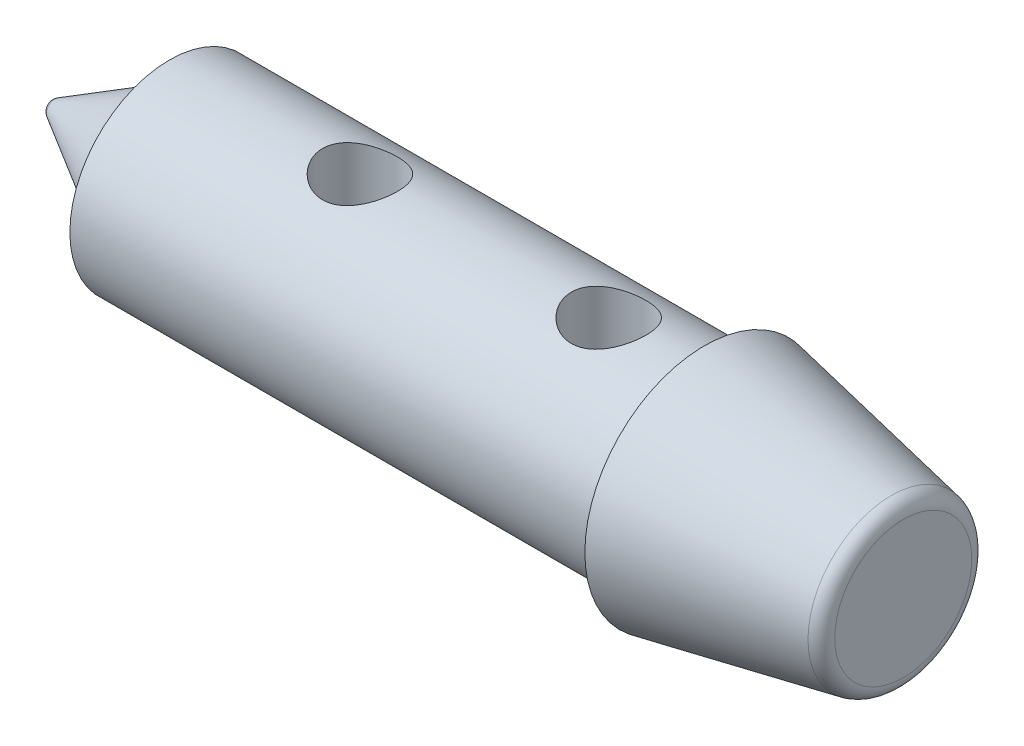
ISO-10303-21;
HEADER;
FILE_DESCRIPTION(('STEP AP214'),'2;1');
FILE_NAME('part.step','',(''),(''),'','','');
FILE_SCHEMA(('AUTOMOTIVE_DESIGN { 1 0 10303 214 1 1 1 1 }'));
ENDSEC;
DATA;
#1=APPLICATION_CONTEXT('core data for automotive mechanical design processes');
#2=APPLICATION_PROTOCOL_DEFINITION('international standard','automotive_design',2000,#1);
#3=PRODUCT_CONTEXT('',#1,'mechanical');
#4=PRODUCT('Part','Part','',(#3));
#5=PRODUCT_RELATED_PRODUCT_CATEGORY('part','',(#4));
#6=PRODUCT_DEFINITION_FORMATION('','',#4);
#7=PRODUCT_DEFINITION_CONTEXT('part definition',#1,'design');
#8=PRODUCT_DEFINITION('design','',#6,#7);
#9=PRODUCT_DEFINITION_SHAPE('','',#8);
#10=(LENGTH_UNIT() NAMED_UNIT(*) SI_UNIT(.MILLI.,.METRE.));
#11=(NAMED_UNIT(*) PLANE_ANGLE_UNIT() SI_UNIT($,.RADIAN.));
#12=(NAMED_UNIT(*) SI_UNIT($,.STERADIAN.) SOLID_ANGLE_UNIT());
#13=UNCERTAINTY_MEASURE_WITH_UNIT(LENGTH_MEASURE(1.E-05),#10,'distance_accuracy_value','');
#14=(GEOMETRIC_REPRESENTATION_CONTEXT(3) GLOBAL_UNCERTAINTY_ASSIGNED_CONTEXT((#13)) GLOBAL_UNIT_ASSIGNED_CONTEXT((#10,
#11,#12)) REPRESENTATION_CONTEXT('',''));
#15=CARTESIAN_POINT('',(0.,0.,0.));
#16=DIRECTION('',(0.,0.,1.));
#17=DIRECTION('',(1.,0.,0.));
#18=AXIS2_PLACEMENT_3D('',#15,#16,#17);
#19=CARTESIAN_POINT('',(0.852323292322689,0.,0.));
#20=DIRECTION('',(1.,0.,0.));
#21=DIRECTION('',(0.,0.,-1.));
#22=AXIS2_PLACEMENT_3D('',#19,#20,#21);
#23=CONICAL_SURFACE('',#22,3.75,0.523598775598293);
#24=CARTESIAN_POINT('',(-4.89286723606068,0.,0.));
#25=DIRECTION('',(-1.,0.,0.));
#26=DIRECTION('',(0.,0.,1.));
#27=AXIS2_PLACEMENT_3D('',#24,#25,#26);
#28=CIRCLE('',#27,0.433012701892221);
#29=CARTESIAN_POINT('',(-4.89286723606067,0.,-0.433012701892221));
#30=VERTEX_POINT('',#29);
#31=EDGE_CURVE('E109',#30,#30,#28,.T.);
#32=CARTESIAN_POINT('',(0.852323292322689,0.,0.));
#33=DIRECTION('',(-1.,0.,0.));
#34=DIRECTION('',(0.,0.,1.));
#35=AXIS2_PLACEMENT_3D('',#32,#33,#34);
#36=CIRCLE('',#35,3.75);
#37=CARTESIAN_POINT('',(0.852323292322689,0.,-3.75));
#38=VERTEX_POINT('',#37);
#39=EDGE_CURVE('E96',#38,#38,#36,.T.);
#40=CARTESIAN_POINT('',(-4.89286723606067,0.,-0.433012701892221));
#41=CARTESIAN_POINT('',(-4.83302150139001,0.,-0.467564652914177));
#42=CARTESIAN_POINT('',(-4.77317576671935,0.,-0.502116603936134));
#43=CARTESIAN_POINT('',(-4.65348429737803,0.,-0.571220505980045));
#44=CARTESIAN_POINT('',(-4.59363856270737,0.,-0.605772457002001));
#45=CARTESIAN_POINT('',(-4.47394709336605,0.,-0.674876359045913));
#46=CARTESIAN_POINT('',(-4.41410135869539,0.,-0.709428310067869));
#47=CARTESIAN_POINT('',(-4.29440988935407,0.,-0.778532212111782));
#48=CARTESIAN_POINT('',(-4.23456415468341,0.,-0.813084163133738));
#49=CARTESIAN_POINT('',(-4.11487268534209,0.,-0.88218806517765));
#50=CARTESIAN_POINT('',(-4.05502695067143,0.,-0.916740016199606));
#51=CARTESIAN_POINT('',(-3.93533548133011,0.,-0.985843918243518));
#52=CARTESIAN_POINT('',(-3.87548974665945,0.,-1.02039586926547));
#53=CARTESIAN_POINT('',(-3.75579827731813,0.,-1.08949977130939));
#54=CARTESIAN_POINT('',(-3.69595254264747,0.,-1.12405172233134));
#55=CARTESIAN_POINT('',(-3.57626107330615,0.,-1.19315562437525));
#56=CARTESIAN_POINT('',(-3.51641533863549,0.,-1.22770757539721));
#57=CARTESIAN_POINT('',(-3.39672386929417,0.,-1.29681147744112));
#58=CARTESIAN_POINT('',(-3.33687813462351,0.,-1.33136342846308));
#59=CARTESIAN_POINT('',(-3.21718666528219,0.,-1.40046733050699));
#60=CARTESIAN_POINT('',(-3.15734093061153,0.,-1.43501928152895));
#61=CARTESIAN_POINT('',(-3.03764946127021,0.,-1.50412318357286));
#62=CARTESIAN_POINT('',(-2.97780372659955,0.,-1.53867513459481));
#63=CARTESIAN_POINT('',(-2.85811225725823,0.,-1.60777903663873));
#64=CARTESIAN_POINT('',(-2.79826652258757,0.,-1.64233098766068));
#65=CARTESIAN_POINT('',(-2.67857505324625,0.,-1.71143488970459));
#66=CARTESIAN_POINT('',(-2.61872931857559,0.,-1.74598684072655));
#67=CARTESIAN_POINT('',(-2.49903784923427,0.,-1.81509074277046));
#68=CARTESIAN_POINT('',(-2.43919211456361,0.,-1.84964269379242));
#69=CARTESIAN_POINT('',(-2.31950064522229,0.,-1.91874659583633));
#70=CARTESIAN_POINT('',(-2.25965491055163,0.,-1.95329854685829));
#71=CARTESIAN_POINT('',(-2.13996344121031,0.,-2.0224024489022));
#72=CARTESIAN_POINT('',(-2.08011770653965,0.,-2.05695439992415));
#73=CARTESIAN_POINT('',(-1.96042623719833,0.,-2.12605830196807));
#74=CARTESIAN_POINT('',(-1.90058050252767,0.,-2.16061025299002));
#75=CARTESIAN_POINT('',(-1.78088903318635,0.,-2.22971415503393));
#76=CARTESIAN_POINT('',(-1.72104329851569,0.,-2.26426610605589));
#77=CARTESIAN_POINT('',(-1.60135182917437,0.,-2.3333700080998));
#78=CARTESIAN_POINT('',(-1.54150609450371,0.,-2.36792195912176));
#79=CARTESIAN_POINT('',(-1.42181462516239,0.,-2.43702586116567));
#80=CARTESIAN_POINT('',(-1.36196889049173,0.,-2.47157781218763));
#81=CARTESIAN_POINT('',(-1.24227742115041,0.,-2.54068171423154));
#82=CARTESIAN_POINT('',(-1.18243168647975,0.,-2.57523366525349));
#83=CARTESIAN_POINT('',(-1.06274021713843,0.,-2.64433756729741));
#84=CARTESIAN_POINT('',(-1.00289448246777,0.,-2.67888951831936));
#85=CARTESIAN_POINT('',(-0.883203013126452,0.,-2.74799342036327));
#86=CARTESIAN_POINT('',(-0.823357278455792,0.,-2.78254537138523));
#87=CARTESIAN_POINT('',(-0.703665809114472,0.,-2.85164927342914));
#88=CARTESIAN_POINT('',(-0.643820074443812,0.,-2.8862012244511));
#89=CARTESIAN_POINT('',(-0.524128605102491,0.,-2.95530512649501));
#90=CARTESIAN_POINT('',(-0.464282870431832,0.,-2.98985707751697));
#91=CARTESIAN_POINT('',(-0.344591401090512,0.,-3.05896097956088));
#92=CARTESIAN_POINT('',(-0.284745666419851,0.,-3.09351293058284));
#93=CARTESIAN_POINT('',(-0.165054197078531,0.,-3.16261683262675));
#94=CARTESIAN_POINT('',(-0.105208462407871,0.,-3.1971687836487));
#95=CARTESIAN_POINT('',(0.0144830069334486,0.,-3.26627268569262));
#96=CARTESIAN_POINT('',(0.0743287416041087,0.,-3.30082463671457));
#97=CARTESIAN_POINT('',(0.194020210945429,0.,-3.36992853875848));
#98=CARTESIAN_POINT('',(0.253865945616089,0.,-3.40448048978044));
#99=CARTESIAN_POINT('',(0.373557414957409,0.,-3.47358439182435));
#100=CARTESIAN_POINT('',(0.433403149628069,0.,-3.50813634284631));
#101=CARTESIAN_POINT('',(0.553094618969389,0.,-3.57724024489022));
#102=CARTESIAN_POINT('',(0.612940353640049,0.,-3.61179219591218));
#103=CARTESIAN_POINT('',(0.732631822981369,0.,-3.68089609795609));
#104=CARTESIAN_POINT('',(0.792477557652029,0.,-3.71544804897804));
#105=CARTESIAN_POINT('',(0.852323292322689,0.,-3.75));
#106=B_SPLINE_CURVE_WITH_KNOTS('',3,(#40,#41,#42,#43,#44,#45,#46,#47,#48,#49,#50,#51,#52,#53,
#54,#55,#56,#57,#58,#59,#60,#61,#62,#63,#64,#65,#66,#67,#68,#69,#70,#71,#72,#73,#74,#75,#76,#77,
#78,#79,#80,#81,#82,#83,#84,#85,#86,#87,#88,#89,#90,#91,#92,#93,#94,#95,#96,#97,#98,#99,#100,
#101,#102,#103,#104,#105),.UNSPECIFIED.,.F.,.F.,(4,2,2,2,2,2,2,2,2,2,2,2,2,2,2,2,2,2,2,2,2,2,2,
2,2,2,2,2,2,2,2,2,4),(0.,0.207311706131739,0.414623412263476,0.621935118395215,
0.829246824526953,1.03655853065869,1.24387023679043,1.45118194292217,1.65849364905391,
1.86580535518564,2.07311706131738,2.28042876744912,2.48774047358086,2.6950521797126,
2.90236388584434,3.10967559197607,3.31698729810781,3.52429900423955,3.73161071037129,
3.93892241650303,4.14623412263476,4.3535458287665,4.56085753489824,4.76816924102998,
4.97548094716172,5.18279265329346,5.3901043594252,5.59741606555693,5.80472777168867,
6.01203947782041,6.21935118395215,6.42666289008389,6.63397459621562),.UNSPECIFIED.);
#107=EDGE_CURVE('BSEAM39',#30,#38,#106,.T.);
#108=ORIENTED_EDGE('',*,*,#31,.F.);
#109=ORIENTED_EDGE('',*,*,#39,.T.);
#110=ORIENTED_EDGE('',*,*,#107,.T.);
#111=ORIENTED_EDGE('',*,*,#107,.F.);
#112=EDGE_LOOP('',(#108,#110,#109,#111));
#113=FACE_BOUND('',#112,.T.);
#114=ADVANCED_FACE('F39',(#113),#23,.T.);
#115=CARTESIAN_POINT('',(-4.64286723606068,0.,0.));
#116=DIRECTION('',(-1.,0.,0.));
#117=DIRECTION('',(0.,1.,0.));
#118=AXIS2_PLACEMENT_3D('',#115,#116,#117);
#119=SPHERICAL_SURFACE('',#118,0.5);
#120=ORIENTED_EDGE('',*,*,#31,.T.);
#121=EDGE_LOOP('',(#120));
#122=FACE_BOUND('',#121,.T.);
#123=ADVANCED_FACE('F131',(#122),#119,.T.);
#124=CARTESIAN_POINT('',(37.7273232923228,4.0625,0.));
#125=DIRECTION('',(-1.,0.,0.));
#126=DIRECTION('',(0.,0.,1.));
#127=AXIS2_PLACEMENT_3D('',#124,#125,#126);
#128=PLANE('',#127);
#129=CARTESIAN_POINT('',(37.7273232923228,0.,0.));
#130=DIRECTION('',(-1.,0.,0.));
#131=DIRECTION('',(0.,0.,1.));
#132=AXIS2_PLACEMENT_3D('',#129,#130,#131);
#133=CIRCLE('',#132,3.44386503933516);
#134=CARTESIAN_POINT('',(37.7273232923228,0.,3.44386503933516));
#135=VERTEX_POINT('',#134);
#136=EDGE_CURVE('E50',#135,#135,#133,.F.);
#137=ORIENTED_EDGE('',*,*,#136,.T.);
#138=EDGE_LOOP('',(#137));
#139=FACE_BOUND('',#138,.T.);
#140=ADVANCED_FACE('F137',(#139),#128,.F.);
#141=CARTESIAN_POINT('',(37.7273232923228,0.,0.));
#142=DIRECTION('',(-1.,0.,0.));
#143=DIRECTION('',(0.,0.,1.));
#144=AXIS2_PLACEMENT_3D('',#141,#142,#143);
#145=CONICAL_SURFACE('',#144,4.0625,0.191378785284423);
#146=CARTESIAN_POINT('',(37.1199828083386,0.,0.));
#147=DIRECTION('',(1.,0.,0.));
#148=DIRECTION('',(0.,0.,-1.));
#149=AXIS2_PLACEMENT_3D('',#146,#147,#148);
#150=CIRCLE('',#149,4.18017221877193);
#151=CARTESIAN_POINT('',(37.1199828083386,0.,-4.18017221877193));
#152=VERTEX_POINT('',#151);
#153=EDGE_CURVE('E54',#152,#152,#150,.F.);
#154=ORIENTED_EDGE('',*,*,#153,.T.);
#155=EDGE_LOOP('',(#154));
#156=FACE_BOUND('',#155,.T.);
#157=CARTESIAN_POINT('',(27.7273232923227,0.,0.));
#158=DIRECTION('',(-1.,0.,0.));
#159=DIRECTION('',(0.,0.,1.));
#160=AXIS2_PLACEMENT_3D('',#157,#158,#159);
#161=CIRCLE('',#160,6.);
#162=CARTESIAN_POINT('',(27.7273232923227,0.,6.));
#163=VERTEX_POINT('',#162);
#164=EDGE_CURVE('E105',#163,#163,#161,.T.);
#165=ORIENTED_EDGE('',*,*,#164,.F.);
#166=EDGE_LOOP('',(#165));
#167=FACE_BOUND('',#166,.T.);
#168=ADVANCED_FACE('F129',(#156,#167),#145,.T.);
#169=CARTESIAN_POINT('',(27.7273232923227,5.,0.));
#170=DIRECTION('',(1.,0.,0.));
#171=DIRECTION('',(0.,0.,-1.));
#172=AXIS2_PLACEMENT_3D('',#169,#170,#171);
#173=PLANE('',#172);
#174=CARTESIAN_POINT('',(27.7273232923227,0.,0.));
#175=DIRECTION('',(1.,0.,0.));
#176=DIRECTION('',(0.,0.,-1.));
#177=AXIS2_PLACEMENT_3D('',#174,#175,#176);
#178=CIRCLE('',#177,5.2);
#179=CARTESIAN_POINT('',(27.7273232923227,0.,-5.2));
#180=VERTEX_POINT('',#179);
#181=EDGE_CURVE('E10',#180,#180,#178,.T.);
#182=ORIENTED_EDGE('',*,*,#181,.T.);
#183=EDGE_LOOP('',(#182));
#184=FACE_BOUND('',#183,.T.);
#185=ORIENTED_EDGE('',*,*,#164,.T.);
#186=EDGE_LOOP('',(#185));
#187=FACE_BOUND('',#186,.T.);
#188=ADVANCED_FACE('F123',(#184,#187),#173,.F.);
#189=CARTESIAN_POINT('',(-4.64286723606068,0.,0.));
#190=DIRECTION('',(-1.,0.,0.));
#191=DIRECTION('',(0.,0.,1.));
#192=AXIS2_PLACEMENT_3D('',#189,#190,#191);
#193=CYLINDRICAL_SURFACE('',#192,5.);
#194=CARTESIAN_POINT('',(27.5273232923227,0.,0.));
#195=DIRECTION('',(1.,0.,0.));
#196=DIRECTION('',(0.,0.,-1.));
#197=AXIS2_PLACEMENT_3D('',#194,#195,#196);
#198=CIRCLE('',#197,5.);
#199=CARTESIAN_POINT('',(27.5273232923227,0.,-5.));
#200=VERTEX_POINT('',#199);
#201=EDGE_CURVE('E46',#200,#200,#198,.F.);
#202=ORIENTED_EDGE('',*,*,#201,.T.);
#203=EDGE_LOOP('',(#202));
#204=FACE_BOUND('',#203,.T.);
#205=CARTESIAN_POINT('',(10.4273232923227,4.63512405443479,-1.87499999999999));
#206=CARTESIAN_POINT('',(10.5285826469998,4.63512050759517,-1.87500380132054));
#207=CARTESIAN_POINT('',(10.6298169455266,4.63847825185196,-1.86676996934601));
#208=CARTESIAN_POINT('',(10.8292333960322,4.65145199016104,-1.83420234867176));
#209=CARTESIAN_POINT('',(10.92741563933,4.66106779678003,-1.80986904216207));
#210=CARTESIAN_POINT('',(11.1177925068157,4.68531850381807,-1.74612072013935));
#211=CARTESIAN_POINT('',(11.2100008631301,4.6999413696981,-1.70674184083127));
#212=CARTESIAN_POINT('',(11.3865381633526,4.73253917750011,-1.61414820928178));
#213=CARTESIAN_POINT('',(11.4708647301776,4.75051512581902,-1.56092930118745));
#214=CARTESIAN_POINT('',(11.6334361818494,4.78879468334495,-1.43933326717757));
#215=CARTESIAN_POINT('',(11.7112339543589,4.80916677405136,-1.37037976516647));
#216=CARTESIAN_POINT('',(11.8544768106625,4.84937188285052,-1.2204947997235));
#217=CARTESIAN_POINT('',(11.9199192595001,4.86920478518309,-1.1395607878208));
#218=CARTESIAN_POINT('',(12.0387476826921,4.90691092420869,-0.964618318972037));
#219=CARTESIAN_POINT('',(12.0916476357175,4.92469451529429,-0.870258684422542));
#220=CARTESIAN_POINT('',(12.1806372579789,4.95547509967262,-0.673194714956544));
#221=CARTESIAN_POINT('',(12.2167327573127,4.96847375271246,-0.570493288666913));
#222=CARTESIAN_POINT('',(12.2695206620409,4.98773371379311,-0.364361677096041));
#223=CARTESIAN_POINT('',(12.2869828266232,4.99426144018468,-0.261153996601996));
#224=CARTESIAN_POINT('',(12.3044747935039,5.00080017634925,-0.053080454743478));
#225=CARTESIAN_POINT('',(12.3045102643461,5.00081330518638,0.0517848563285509));
#226=CARTESIAN_POINT('',(12.2875960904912,4.99449082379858,0.254679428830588));
#227=CARTESIAN_POINT('',(12.2714866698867,4.98846927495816,0.352790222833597));
#228=CARTESIAN_POINT('',(12.2241533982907,4.97116593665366,0.544799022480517));
#229=CARTESIAN_POINT('',(12.192928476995,4.95988377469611,0.638696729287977));
#230=CARTESIAN_POINT('',(12.115860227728,4.93297211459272,0.821236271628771));
#231=CARTESIAN_POINT('',(12.0698107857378,4.91728174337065,0.909781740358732));
#232=CARTESIAN_POINT('',(11.9645831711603,4.88314137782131,1.07810825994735));
#233=CARTESIAN_POINT('',(11.9054007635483,4.86469049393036,1.1578864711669));
#234=CARTESIAN_POINT('',(11.7715391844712,4.82565662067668,1.31136310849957));
#235=CARTESIAN_POINT('',(11.6961558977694,4.80501204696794,1.38443268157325));
#236=CARTESIAN_POINT('',(11.534082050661,4.76478075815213,1.51712994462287));
#237=CARTESIAN_POINT('',(11.447388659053,4.74519430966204,1.57675425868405));
#238=CARTESIAN_POINT('',(11.2626739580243,4.70890879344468,1.68207014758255));
#239=CARTESIAN_POINT('',(11.1644439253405,4.69228346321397,1.72742309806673));
#240=CARTESIAN_POINT('',(10.9609530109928,4.66465548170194,1.80070580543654));
#241=CARTESIAN_POINT('',(10.8556960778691,4.65364970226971,1.82864525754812));
#242=CARTESIAN_POINT('',(10.6473533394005,4.63924496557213,1.86487739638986));
#243=CARTESIAN_POINT('',(10.5444681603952,4.63545981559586,1.87416901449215));
#244=CARTESIAN_POINT('',(10.3385615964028,4.63483174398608,1.87572357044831));
#245=CARTESIAN_POINT('',(10.235540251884,4.63798708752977,1.86799076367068));
#246=CARTESIAN_POINT('',(10.0374108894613,4.65049227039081,1.83662166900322));
#247=CARTESIAN_POINT('',(9.94215937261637,4.65954095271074,1.81375772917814));
#248=CARTESIAN_POINT('',(9.75688836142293,4.68245608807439,1.75374718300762));
#249=CARTESIAN_POINT('',(9.66686994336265,4.69632352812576,1.71659765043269));
#250=CARTESIAN_POINT('',(9.49086774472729,4.72795303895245,1.62750365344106));
#251=CARTESIAN_POINT('',(9.40516167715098,4.7458416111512,1.5750568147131));
#252=CARTESIAN_POINT('',(9.24341206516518,4.78328517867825,1.45739147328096));
#253=CARTESIAN_POINT('',(9.16737207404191,4.80284078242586,1.39216829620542));
#254=CARTESIAN_POINT('',(9.02211282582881,4.84291308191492,1.24590917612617));
#255=CARTESIAN_POINT('',(8.95363153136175,4.86341211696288,1.16413292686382));
#256=CARTESIAN_POINT('',(8.83127533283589,4.90187343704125,0.989746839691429));
#257=CARTESIAN_POINT('',(8.77740047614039,4.91983571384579,0.897136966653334));
#258=CARTESIAN_POINT('',(8.68614072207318,4.95118732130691,0.70377041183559));
#259=CARTESIAN_POINT('',(8.64869938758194,4.96459226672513,0.603043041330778));
#260=CARTESIAN_POINT('',(8.59150277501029,4.98536795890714,0.396102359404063));
#261=CARTESIAN_POINT('',(8.57173918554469,4.99274154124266,0.289891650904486));
#262=CARTESIAN_POINT('',(8.55135528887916,5.00035509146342,0.0816694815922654));
#263=CARTESIAN_POINT('',(8.54968643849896,5.00098576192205,-0.0202259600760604));
#264=CARTESIAN_POINT('',(8.56284224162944,4.99606112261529,-0.222783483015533));
#265=CARTESIAN_POINT('',(8.57766490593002,4.99050655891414,-0.323445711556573));
#266=CARTESIAN_POINT('',(8.62264685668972,4.97401362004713,-0.518185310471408));
#267=CARTESIAN_POINT('',(8.65242317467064,4.96320989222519,-0.612363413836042));
#268=CARTESIAN_POINT('',(8.72608580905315,4.9373472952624,-0.794394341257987));
#269=CARTESIAN_POINT('',(8.76997479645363,4.92228762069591,-0.882245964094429));
#270=CARTESIAN_POINT('',(8.87271572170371,4.88863272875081,-1.05317522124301));
#271=CARTESIAN_POINT('',(8.9321190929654,4.86991550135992,-1.13589693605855));
#272=CARTESIAN_POINT('',(9.06333308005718,4.83124384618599,-1.29052168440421));
#273=CARTESIAN_POINT('',(9.13514812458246,4.81128897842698,-1.3624208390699));
#274=CARTESIAN_POINT('',(9.29365345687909,4.77110162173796,-1.49726517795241));
#275=CARTESIAN_POINT('',(9.38092879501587,4.75091006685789,-1.55953749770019));
#276=CARTESIAN_POINT('',(9.56534312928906,4.71372906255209,-1.66855886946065));
#277=CARTESIAN_POINT('',(9.66248314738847,4.69673994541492,-1.71530631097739));
#278=CARTESIAN_POINT('',(9.86851789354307,4.66752837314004,-1.79332358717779));
#279=CARTESIAN_POINT('',(9.9777412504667,4.65554754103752,-1.82382503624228));
#280=CARTESIAN_POINT('',(10.2004298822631,4.63934992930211,-1.86465445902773));
#281=CARTESIAN_POINT('',(10.3138923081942,4.63512802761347,-1.87499574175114));
#282=CARTESIAN_POINT('',(10.4273232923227,4.63512405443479,-1.87499999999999));
#283=B_SPLINE_CURVE_WITH_KNOTS('',3,(#205,#206,#207,#208,#209,#210,#211,#212,#213,#214,#215,
#216,#217,#218,#219,#220,#221,#222,#223,#224,#225,#226,#227,#228,#229,#230,#231,#232,#233,#234,
#235,#236,#237,#238,#239,#240,#241,#242,#243,#244,#245,#246,#247,#248,#249,#250,#251,#252,#253,
#254,#255,#256,#257,#258,#259,#260,#261,#262,#263,#264,#265,#266,#267,#268,#269,#270,#271,#272,
#273,#274,#275,#276,#277,#278,#279,#280,#281,#282),.UNSPECIFIED.,.T.,.F.,(4,2,2,2,2,2,2,2,2,2,2,
2,2,2,2,2,2,2,2,2,2,2,2,2,2,2,2,2,2,2,2,2,2,2,2,2,2,2,4),(0.,0.303355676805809,
0.606702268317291,0.90932482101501,1.21203834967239,1.52843315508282,1.844895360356,
2.17212590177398,2.49924282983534,2.8122502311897,3.12515581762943,3.42258091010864,
3.7200270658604,4.02180164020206,4.3236736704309,4.64320843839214,4.96282334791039,
5.28953240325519,5.61605939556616,5.9245707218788,6.23300494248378,6.52679807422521,
6.8206514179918,7.12551951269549,7.43049935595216,7.75481271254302,8.07912712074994,
8.40231886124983,8.7253585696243,9.02957150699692,9.33374775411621,9.63050342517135,
9.9273152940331,10.236604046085,10.5460033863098,10.8717324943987,11.1974953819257,
11.5375397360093,11.8773595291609),.UNSPECIFIED.);
#284=CARTESIAN_POINT('',(10.4273232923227,4.63512405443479,-1.87499999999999));
#285=VERTEX_POINT('',#284);
#286=EDGE_CURVE('E60',#285,#285,#283,.T.);
#287=ORIENTED_EDGE('',*,*,#286,.T.);
#288=EDGE_LOOP('',(#287));
#289=FACE_BOUND('',#288,.T.);
#290=CARTESIAN_POINT('',(10.4273232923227,-4.63512405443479,-1.87499999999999));
#291=CARTESIAN_POINT('',(10.3260639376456,-4.63512050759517,-1.87500380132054));
#292=CARTESIAN_POINT('',(10.2248296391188,-4.63847825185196,-1.86676996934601));
#293=CARTESIAN_POINT('',(10.0254131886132,-4.65145199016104,-1.83420234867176));
#294=CARTESIAN_POINT('',(9.92723094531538,-4.66106779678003,-1.80986904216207));
#295=CARTESIAN_POINT('',(9.73685407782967,-4.68531850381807,-1.74612072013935));
#296=CARTESIAN_POINT('',(9.64464572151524,-4.6999413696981,-1.70674184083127));
#297=CARTESIAN_POINT('',(9.46810842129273,-4.73253917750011,-1.61414820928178));
#298=CARTESIAN_POINT('',(9.38378185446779,-4.75051512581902,-1.56092930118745));
#299=CARTESIAN_POINT('',(9.221210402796,-4.78879468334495,-1.43933326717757));
#300=CARTESIAN_POINT('',(9.14341263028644,-4.80916677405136,-1.37037976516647));
#301=CARTESIAN_POINT('',(9.00016977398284,-4.84937188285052,-1.2204947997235));
#302=CARTESIAN_POINT('',(8.93472732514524,-4.86920478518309,-1.1395607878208));
#303=CARTESIAN_POINT('',(8.81589890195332,-4.90691092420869,-0.964618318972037));
#304=CARTESIAN_POINT('',(8.76299894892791,-4.92469451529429,-0.870258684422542));
#305=CARTESIAN_POINT('',(8.67400932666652,-4.95547509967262,-0.673194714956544));
#306=CARTESIAN_POINT('',(8.63791382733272,-4.96847375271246,-0.570493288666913));
#307=CARTESIAN_POINT('',(8.58512592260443,-4.98773371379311,-0.364361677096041));
#308=CARTESIAN_POINT('',(8.56766375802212,-4.99426144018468,-0.261153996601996));
#309=CARTESIAN_POINT('',(8.55017179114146,-5.00080017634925,-0.053080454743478));
#310=CARTESIAN_POINT('',(8.55013632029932,-5.00081330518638,0.0517848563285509));
#311=CARTESIAN_POINT('',(8.56705049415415,-4.99449082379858,0.254679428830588));
#312=CARTESIAN_POINT('',(8.58315991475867,-4.98846927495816,0.352790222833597));
#313=CARTESIAN_POINT('',(8.63049318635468,-4.97116593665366,0.544799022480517));
#314=CARTESIAN_POINT('',(8.66171810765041,-4.95988377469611,0.638696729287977));
#315=CARTESIAN_POINT('',(8.73878635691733,-4.93297211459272,0.821236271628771));
#316=CARTESIAN_POINT('',(8.78483579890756,-4.91728174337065,0.909781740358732));
#317=CARTESIAN_POINT('',(8.89006341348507,-4.88314137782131,1.07810825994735));
#318=CARTESIAN_POINT('',(8.94924582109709,-4.86469049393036,1.1578864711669));
#319=CARTESIAN_POINT('',(9.08310740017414,-4.82565662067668,1.31136310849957));
#320=CARTESIAN_POINT('',(9.15849068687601,-4.80501204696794,1.38443268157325));
#321=CARTESIAN_POINT('',(9.32056453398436,-4.76478075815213,1.51712994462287));
#322=CARTESIAN_POINT('',(9.40725792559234,-4.74519430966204,1.57675425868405));
#323=CARTESIAN_POINT('',(9.59197262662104,-4.70890879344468,1.68207014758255));
#324=CARTESIAN_POINT('',(9.69020265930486,-4.69228346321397,1.72742309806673));
#325=CARTESIAN_POINT('',(9.89369357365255,-4.66465548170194,1.80070580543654));
#326=CARTESIAN_POINT('',(9.99895050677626,-4.65364970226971,1.82864525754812));
#327=CARTESIAN_POINT('',(10.2072932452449,-4.63924496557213,1.86487739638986));
#328=CARTESIAN_POINT('',(10.3101784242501,-4.63545981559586,1.87416901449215));
#329=CARTESIAN_POINT('',(10.5160849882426,-4.63483174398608,1.87572357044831));
#330=CARTESIAN_POINT('',(10.6191063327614,-4.63798708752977,1.86799076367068));
#331=CARTESIAN_POINT('',(10.8172356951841,-4.65049227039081,1.83662166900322));
#332=CARTESIAN_POINT('',(10.912487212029,-4.65954095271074,1.81375772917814));
#333=CARTESIAN_POINT('',(11.0977582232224,-4.68245608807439,1.75374718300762));
#334=CARTESIAN_POINT('',(11.1877766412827,-4.69632352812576,1.71659765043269));
#335=CARTESIAN_POINT('',(11.3637788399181,-4.72795303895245,1.62750365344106));
#336=CARTESIAN_POINT('',(11.4494849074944,-4.7458416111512,1.5750568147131));
#337=CARTESIAN_POINT('',(11.6112345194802,-4.78328517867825,1.45739147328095));
#338=CARTESIAN_POINT('',(11.6872745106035,-4.80284078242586,1.39216829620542));
#339=CARTESIAN_POINT('',(11.8325337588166,-4.84291308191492,1.24590917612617));
#340=CARTESIAN_POINT('',(11.9010150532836,-4.86341211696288,1.16413292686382));
#341=CARTESIAN_POINT('',(12.0233712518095,-4.90187343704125,0.989746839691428));
#342=CARTESIAN_POINT('',(12.077246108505,-4.91983571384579,0.897136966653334));
#343=CARTESIAN_POINT('',(12.1685058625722,-4.95118732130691,0.70377041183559));
#344=CARTESIAN_POINT('',(12.2059471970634,-4.96459226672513,0.603043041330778));
#345=CARTESIAN_POINT('',(12.2631438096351,-4.98536795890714,0.396102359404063));
#346=CARTESIAN_POINT('',(12.2829073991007,-4.99274154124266,0.289891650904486));
#347=CARTESIAN_POINT('',(12.3032912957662,-5.00035509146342,0.0816694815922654));
#348=CARTESIAN_POINT('',(12.3049601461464,-5.00098576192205,-0.0202259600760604));
#349=CARTESIAN_POINT('',(12.2918043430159,-4.99606112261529,-0.222783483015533));
#350=CARTESIAN_POINT('',(12.2769816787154,-4.99050655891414,-0.323445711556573));
#351=CARTESIAN_POINT('',(12.2319997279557,-4.97401362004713,-0.518185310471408));
#352=CARTESIAN_POINT('',(12.2022234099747,-4.96320989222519,-0.612363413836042));
#353=CARTESIAN_POINT('',(12.1285607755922,-4.9373472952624,-0.794394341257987));
#354=CARTESIAN_POINT('',(12.0846717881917,-4.92228762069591,-0.882245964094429));
#355=CARTESIAN_POINT('',(11.9819308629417,-4.88863272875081,-1.05317522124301));
#356=CARTESIAN_POINT('',(11.92252749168,-4.86991550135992,-1.13589693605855));
#357=CARTESIAN_POINT('',(11.7913135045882,-4.83124384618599,-1.29052168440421));
#358=CARTESIAN_POINT('',(11.7194984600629,-4.81128897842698,-1.3624208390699));
#359=CARTESIAN_POINT('',(11.5609931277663,-4.77110162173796,-1.49726517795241));
#360=CARTESIAN_POINT('',(11.4737177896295,-4.75091006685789,-1.55953749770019));
#361=CARTESIAN_POINT('',(11.2893034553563,-4.71372906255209,-1.66855886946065));
#362=CARTESIAN_POINT('',(11.1921634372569,-4.69673994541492,-1.71530631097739));
#363=CARTESIAN_POINT('',(10.9861286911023,-4.66752837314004,-1.79332358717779));
#364=CARTESIAN_POINT('',(10.8769053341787,-4.65554754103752,-1.82382503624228));
#365=CARTESIAN_POINT('',(10.6542167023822,-4.63934992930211,-1.86465445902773));
#366=CARTESIAN_POINT('',(10.5407542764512,-4.63512802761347,-1.87499574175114));
#367=CARTESIAN_POINT('',(10.4273232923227,-4.63512405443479,-1.87499999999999));
#368=B_SPLINE_CURVE_WITH_KNOTS('',3,(#290,#291,#292,#293,#294,#295,#296,#297,#298,#299,#300,
#301,#302,#303,#304,#305,#306,#307,#308,#309,#310,#311,#312,#313,#314,#315,#316,#317,#318,#319,
#320,#321,#322,#323,#324,#325,#326,#327,#328,#329,#330,#331,#332,#333,#334,#335,#336,#337,#338,
#339,#340,#341,#342,#343,#344,#345,#346,#347,#348,#349,#350,#351,#352,#353,#354,#355,#356,#357,
#358,#359,#360,#361,#362,#363,#364,#365,#366,#367),.UNSPECIFIED.,.T.,.F.,(4,2,2,2,2,2,2,2,2,2,2,
2,2,2,2,2,2,2,2,2,2,2,2,2,2,2,2,2,2,2,2,2,2,2,2,2,2,2,4),(0.,0.303355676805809,
0.606702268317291,0.909324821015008,1.21203834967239,1.52843315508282,1.844895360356,
2.17212590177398,2.49924282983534,2.8122502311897,3.12515581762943,3.42258091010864,
3.7200270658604,4.02180164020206,4.3236736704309,4.64320843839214,4.96282334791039,
5.28953240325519,5.61605939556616,5.92457072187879,6.23300494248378,6.52679807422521,
6.8206514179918,7.12551951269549,7.43049935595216,7.75481271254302,8.07912712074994,
8.40231886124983,8.7253585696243,9.02957150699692,9.33374775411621,9.63050342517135,
9.9273152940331,10.236604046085,10.5460033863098,10.8717324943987,11.1974953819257,
11.5375397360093,11.8773595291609),.UNSPECIFIED.);
#369=CARTESIAN_POINT('',(10.4273232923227,-4.63512405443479,-1.87499999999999));
#370=VERTEX_POINT('',#369);
#371=EDGE_CURVE('E59',#370,#370,#368,.T.);
#372=ORIENTED_EDGE('',*,*,#371,.T.);
#373=EDGE_LOOP('',(#372));
#374=FACE_BOUND('',#373,.T.);
#375=CARTESIAN_POINT('',(22.9273232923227,4.63512405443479,-1.87499999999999));
#376=CARTESIAN_POINT('',(23.0285826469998,4.63512050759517,-1.87500380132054));
#377=CARTESIAN_POINT('',(23.1298169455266,4.63847825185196,-1.86676996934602));
#378=CARTESIAN_POINT('',(23.3292333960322,4.65145199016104,-1.83420234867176));
#379=CARTESIAN_POINT('',(23.42741563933,4.66106779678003,-1.80986904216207));
#380=CARTESIAN_POINT('',(23.6177925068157,4.68531850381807,-1.74612072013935));
#381=CARTESIAN_POINT('',(23.7100008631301,4.6999413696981,-1.70674184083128));
#382=CARTESIAN_POINT('',(23.8865381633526,4.73253917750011,-1.61414820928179));
#383=CARTESIAN_POINT('',(23.9708647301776,4.75051512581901,-1.56092930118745));
#384=CARTESIAN_POINT('',(24.1334361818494,4.78879468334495,-1.43933326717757));
#385=CARTESIAN_POINT('',(24.2112339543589,4.80916677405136,-1.37037976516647));
#386=CARTESIAN_POINT('',(24.3544768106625,4.84937188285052,-1.22049479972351));
#387=CARTESIAN_POINT('',(24.4199192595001,4.86920478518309,-1.13956078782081));
#388=CARTESIAN_POINT('',(24.5387476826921,4.90691092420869,-0.964618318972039));
#389=CARTESIAN_POINT('',(24.5916476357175,4.92469451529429,-0.870258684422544));
#390=CARTESIAN_POINT('',(24.6806372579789,4.95547509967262,-0.673194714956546));
#391=CARTESIAN_POINT('',(24.7167327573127,4.96847375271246,-0.570493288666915));
#392=CARTESIAN_POINT('',(24.7695206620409,4.98773371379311,-0.364361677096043));
#393=CARTESIAN_POINT('',(24.7869828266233,4.99426144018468,-0.261153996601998));
#394=CARTESIAN_POINT('',(24.8044747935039,5.00080017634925,-0.0530804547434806));
#395=CARTESIAN_POINT('',(24.8045102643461,5.00081330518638,0.0517848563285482));
#396=CARTESIAN_POINT('',(24.7875960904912,4.99449082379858,0.254679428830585));
#397=CARTESIAN_POINT('',(24.7714866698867,4.98846927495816,0.352790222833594));
#398=CARTESIAN_POINT('',(24.7241533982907,4.97116593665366,0.544799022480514));
#399=CARTESIAN_POINT('',(24.692928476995,4.95988377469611,0.638696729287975));
#400=CARTESIAN_POINT('',(24.615860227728,4.93297211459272,0.821236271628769));
#401=CARTESIAN_POINT('',(24.5698107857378,4.91728174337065,0.909781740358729));
#402=CARTESIAN_POINT('',(24.4645831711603,4.88314137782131,1.07810825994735));
#403=CARTESIAN_POINT('',(24.4054007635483,4.86469049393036,1.1578864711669));
#404=CARTESIAN_POINT('',(24.2715391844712,4.82565662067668,1.31136310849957));
#405=CARTESIAN_POINT('',(24.1961558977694,4.80501204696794,1.38443268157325));
#406=CARTESIAN_POINT('',(24.034082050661,4.76478075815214,1.51712994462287));
#407=CARTESIAN_POINT('',(23.947388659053,4.74519430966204,1.57675425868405));
#408=CARTESIAN_POINT('',(23.7626739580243,4.70890879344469,1.68207014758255));
#409=CARTESIAN_POINT('',(23.6644439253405,4.69228346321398,1.72742309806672));
#410=CARTESIAN_POINT('',(23.4609530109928,4.66465548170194,1.80070580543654));
#411=CARTESIAN_POINT('',(23.3556960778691,4.65364970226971,1.82864525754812));
#412=CARTESIAN_POINT('',(23.1473533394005,4.63924496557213,1.86487739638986));
#413=CARTESIAN_POINT('',(23.0444681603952,4.63545981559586,1.87416901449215));
#414=CARTESIAN_POINT('',(22.8385615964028,4.63483174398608,1.87572357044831));
#415=CARTESIAN_POINT('',(22.735540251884,4.63798708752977,1.86799076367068));
#416=CARTESIAN_POINT('',(22.5374108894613,4.65049227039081,1.83662166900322));
#417=CARTESIAN_POINT('',(22.4421593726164,4.65954095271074,1.81375772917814));
#418=CARTESIAN_POINT('',(22.2568883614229,4.68245608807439,1.75374718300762));
#419=CARTESIAN_POINT('',(22.1668699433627,4.69632352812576,1.71659765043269));
#420=CARTESIAN_POINT('',(21.9908677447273,4.72795303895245,1.62750365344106));
#421=CARTESIAN_POINT('',(21.905161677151,4.7458416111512,1.5750568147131));
#422=CARTESIAN_POINT('',(21.7434120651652,4.78328517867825,1.45739147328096));
#423=CARTESIAN_POINT('',(21.6673720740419,4.80284078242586,1.39216829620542));
#424=CARTESIAN_POINT('',(21.5221128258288,4.84291308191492,1.24590917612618));
#425=CARTESIAN_POINT('',(21.4536315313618,4.86341211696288,1.16413292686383));
#426=CARTESIAN_POINT('',(21.3312753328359,4.90187343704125,0.989746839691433));
#427=CARTESIAN_POINT('',(21.2774004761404,4.91983571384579,0.897136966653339));
#428=CARTESIAN_POINT('',(21.1861407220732,4.9511873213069,0.703770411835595));
#429=CARTESIAN_POINT('',(21.1486993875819,4.96459226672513,0.603043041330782));
#430=CARTESIAN_POINT('',(21.0915027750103,4.98536795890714,0.396102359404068));
#431=CARTESIAN_POINT('',(21.0717391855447,4.99274154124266,0.289891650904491));
#432=CARTESIAN_POINT('',(21.0513552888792,5.00035509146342,0.0816694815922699));
#433=CARTESIAN_POINT('',(21.049686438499,5.00098576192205,-0.0202259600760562));
#434=CARTESIAN_POINT('',(21.0628422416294,4.99606112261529,-0.222783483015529));
#435=CARTESIAN_POINT('',(21.07766490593,4.99050655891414,-0.32344571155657));
#436=CARTESIAN_POINT('',(21.1226468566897,4.97401362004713,-0.518185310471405));
#437=CARTESIAN_POINT('',(21.1524231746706,4.96320989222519,-0.61236341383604));
#438=CARTESIAN_POINT('',(21.2260858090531,4.9373472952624,-0.794394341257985));
#439=CARTESIAN_POINT('',(21.2699747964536,4.92228762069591,-0.882245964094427));
#440=CARTESIAN_POINT('',(21.3727157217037,4.88863272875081,-1.05317522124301));
#441=CARTESIAN_POINT('',(21.4321190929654,4.86991550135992,-1.13589693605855));
#442=CARTESIAN_POINT('',(21.5633330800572,4.83124384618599,-1.29052168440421));
#443=CARTESIAN_POINT('',(21.6351481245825,4.81128897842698,-1.3624208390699));
#444=CARTESIAN_POINT('',(21.7936534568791,4.77110162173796,-1.49726517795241));
#445=CARTESIAN_POINT('',(21.8809287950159,4.75091006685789,-1.55953749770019));
#446=CARTESIAN_POINT('',(22.0653431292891,4.71372906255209,-1.66855886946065));
#447=CARTESIAN_POINT('',(22.1624831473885,4.69673994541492,-1.71530631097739));
#448=CARTESIAN_POINT('',(22.3685178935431,4.66752837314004,-1.79332358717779));
#449=CARTESIAN_POINT('',(22.4777412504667,4.65554754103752,-1.82382503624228));
#450=CARTESIAN_POINT('',(22.7004298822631,4.63934992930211,-1.86465445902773));
#451=CARTESIAN_POINT('',(22.8138923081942,4.63512802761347,-1.87499574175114));
#452=CARTESIAN_POINT('',(22.9273232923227,4.63512405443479,-1.87499999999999));
#453=B_SPLINE_CURVE_WITH_KNOTS('',3,(#375,#376,#377,#378,#379,#380,#381,#382,#383,#384,#385,
#386,#387,#388,#389,#390,#391,#392,#393,#394,#395,#396,#397,#398,#399,#400,#401,#402,#403,#404,
#405,#406,#407,#408,#409,#410,#411,#412,#413,#414,#415,#416,#417,#418,#419,#420,#421,#422,#423,
#424,#425,#426,#427,#428,#429,#430,#431,#432,#433,#434,#435,#436,#437,#438,#439,#440,#441,#442,
#443,#444,#445,#446,#447,#448,#449,#450,#451,#452),.UNSPECIFIED.,.T.,.F.,(4,2,2,2,2,2,2,2,2,2,2,
2,2,2,2,2,2,2,2,2,2,2,2,2,2,2,2,2,2,2,2,2,2,2,2,2,2,2,4),(0.,0.303355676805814,0.60670226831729,
0.909324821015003,1.21203834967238,1.52843315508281,1.844895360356,2.17212590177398,
2.49924282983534,2.8122502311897,3.12515581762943,3.42258091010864,3.7200270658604,
4.02180164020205,4.3236736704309,4.64320843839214,4.96282334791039,5.28953240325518,
5.61605939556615,5.92457072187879,6.23300494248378,6.52679807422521,6.8206514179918,
7.12551951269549,7.43049935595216,7.75481271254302,8.07912712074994,8.40231886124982,
8.7253585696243,9.02957150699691,9.33374775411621,9.63050342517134,9.9273152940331,
10.236604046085,10.5460033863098,10.8717324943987,11.1974953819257,11.5375397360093,
11.8773595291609),.UNSPECIFIED.);
#454=CARTESIAN_POINT('',(22.9273232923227,4.63512405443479,-1.87499999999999));
#455=VERTEX_POINT('',#454);
#456=EDGE_CURVE('E67',#455,#455,#453,.T.);
#457=ORIENTED_EDGE('',*,*,#456,.T.);
#458=EDGE_LOOP('',(#457));
#459=FACE_BOUND('',#458,.T.);
#460=CARTESIAN_POINT('',(22.9273232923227,-4.63512405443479,-1.87499999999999));
#461=CARTESIAN_POINT('',(22.8260639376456,-4.63512050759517,-1.87500380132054));
#462=CARTESIAN_POINT('',(22.7248296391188,-4.63847825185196,-1.86676996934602));
#463=CARTESIAN_POINT('',(22.5254131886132,-4.65145199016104,-1.83420234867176));
#464=CARTESIAN_POINT('',(22.4272309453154,-4.66106779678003,-1.80986904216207));
#465=CARTESIAN_POINT('',(22.2368540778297,-4.68531850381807,-1.74612072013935));
#466=CARTESIAN_POINT('',(22.1446457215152,-4.6999413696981,-1.70674184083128));
#467=CARTESIAN_POINT('',(21.9681084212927,-4.73253917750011,-1.61414820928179));
#468=CARTESIAN_POINT('',(21.8837818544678,-4.75051512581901,-1.56092930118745));
#469=CARTESIAN_POINT('',(21.721210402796,-4.78879468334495,-1.43933326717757));
#470=CARTESIAN_POINT('',(21.6434126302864,-4.80916677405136,-1.37037976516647));
#471=CARTESIAN_POINT('',(21.5001697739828,-4.84937188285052,-1.22049479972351));
#472=CARTESIAN_POINT('',(21.4347273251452,-4.86920478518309,-1.13956078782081));
#473=CARTESIAN_POINT('',(21.3158989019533,-4.90691092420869,-0.964618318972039));
#474=CARTESIAN_POINT('',(21.2629989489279,-4.92469451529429,-0.870258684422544));
#475=CARTESIAN_POINT('',(21.1740093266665,-4.95547509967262,-0.673194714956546));
#476=CARTESIAN_POINT('',(21.1379138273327,-4.96847375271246,-0.570493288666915));
#477=CARTESIAN_POINT('',(21.0851259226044,-4.98773371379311,-0.364361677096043));
#478=CARTESIAN_POINT('',(21.0676637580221,-4.99426144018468,-0.261153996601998));
#479=CARTESIAN_POINT('',(21.0501717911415,-5.00080017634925,-0.0530804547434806));
#480=CARTESIAN_POINT('',(21.0501363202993,-5.00081330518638,0.0517848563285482));
#481=CARTESIAN_POINT('',(21.0670504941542,-4.99449082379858,0.254679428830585));
#482=CARTESIAN_POINT('',(21.0831599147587,-4.98846927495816,0.352790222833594));
#483=CARTESIAN_POINT('',(21.1304931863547,-4.97116593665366,0.544799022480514));
#484=CARTESIAN_POINT('',(21.1617181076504,-4.95988377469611,0.638696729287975));
#485=CARTESIAN_POINT('',(21.2387863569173,-4.93297211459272,0.821236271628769));
#486=CARTESIAN_POINT('',(21.2848357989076,-4.91728174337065,0.909781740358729));
#487=CARTESIAN_POINT('',(21.3900634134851,-4.88314137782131,1.07810825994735));
#488=CARTESIAN_POINT('',(21.4492458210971,-4.86469049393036,1.1578864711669));
#489=CARTESIAN_POINT('',(21.5831074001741,-4.82565662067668,1.31136310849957));
#490=CARTESIAN_POINT('',(21.658490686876,-4.80501204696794,1.38443268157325));
#491=CARTESIAN_POINT('',(21.8205645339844,-4.76478075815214,1.51712994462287));
#492=CARTESIAN_POINT('',(21.9072579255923,-4.74519430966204,1.57675425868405));
#493=CARTESIAN_POINT('',(22.091972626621,-4.70890879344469,1.68207014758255));
#494=CARTESIAN_POINT('',(22.1902026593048,-4.69228346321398,1.72742309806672));
#495=CARTESIAN_POINT('',(22.3936935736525,-4.66465548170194,1.80070580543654));
#496=CARTESIAN_POINT('',(22.4989505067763,-4.65364970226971,1.82864525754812));
#497=CARTESIAN_POINT('',(22.7072932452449,-4.63924496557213,1.86487739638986));
#498=CARTESIAN_POINT('',(22.8101784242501,-4.63545981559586,1.87416901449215));
#499=CARTESIAN_POINT('',(23.0160849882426,-4.63483174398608,1.87572357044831));
#500=CARTESIAN_POINT('',(23.1191063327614,-4.63798708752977,1.86799076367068));
#501=CARTESIAN_POINT('',(23.3172356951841,-4.65049227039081,1.83662166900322));
#502=CARTESIAN_POINT('',(23.412487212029,-4.65954095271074,1.81375772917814));
#503=CARTESIAN_POINT('',(23.5977582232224,-4.68245608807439,1.75374718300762));
#504=CARTESIAN_POINT('',(23.6877766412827,-4.69632352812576,1.71659765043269));
#505=CARTESIAN_POINT('',(23.8637788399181,-4.72795303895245,1.62750365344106));
#506=CARTESIAN_POINT('',(23.9494849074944,-4.7458416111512,1.5750568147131));
#507=CARTESIAN_POINT('',(24.1112345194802,-4.78328517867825,1.45739147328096));
#508=CARTESIAN_POINT('',(24.1872745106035,-4.80284078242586,1.39216829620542));
#509=CARTESIAN_POINT('',(24.3325337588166,-4.84291308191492,1.24590917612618));
#510=CARTESIAN_POINT('',(24.4010150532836,-4.86341211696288,1.16413292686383));
#511=CARTESIAN_POINT('',(24.5233712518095,-4.90187343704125,0.989746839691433));
#512=CARTESIAN_POINT('',(24.577246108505,-4.91983571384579,0.897136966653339));
#513=CARTESIAN_POINT('',(24.6685058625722,-4.9511873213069,0.703770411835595));
#514=CARTESIAN_POINT('',(24.7059471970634,-4.96459226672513,0.603043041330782));
#515=CARTESIAN_POINT('',(24.7631438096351,-4.98536795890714,0.396102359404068));
#516=CARTESIAN_POINT('',(24.7829073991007,-4.99274154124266,0.289891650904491));
#517=CARTESIAN_POINT('',(24.8032912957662,-5.00035509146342,0.0816694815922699));
#518=CARTESIAN_POINT('',(24.8049601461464,-5.00098576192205,-0.0202259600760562));
#519=CARTESIAN_POINT('',(24.7918043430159,-4.99606112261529,-0.222783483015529));
#520=CARTESIAN_POINT('',(24.7769816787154,-4.99050655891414,-0.32344571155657));
#521=CARTESIAN_POINT('',(24.7319997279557,-4.97401362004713,-0.518185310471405));
#522=CARTESIAN_POINT('',(24.7022234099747,-4.96320989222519,-0.61236341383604));
#523=CARTESIAN_POINT('',(24.6285607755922,-4.9373472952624,-0.794394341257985));
#524=CARTESIAN_POINT('',(24.5846717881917,-4.92228762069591,-0.882245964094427));
#525=CARTESIAN_POINT('',(24.4819308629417,-4.88863272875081,-1.05317522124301));
#526=CARTESIAN_POINT('',(24.42252749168,-4.86991550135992,-1.13589693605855));
#527=CARTESIAN_POINT('',(24.2913135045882,-4.83124384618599,-1.29052168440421));
#528=CARTESIAN_POINT('',(24.2194984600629,-4.81128897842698,-1.3624208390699));
#529=CARTESIAN_POINT('',(24.0609931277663,-4.77110162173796,-1.49726517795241));
#530=CARTESIAN_POINT('',(23.9737177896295,-4.75091006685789,-1.55953749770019));
#531=CARTESIAN_POINT('',(23.7893034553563,-4.71372906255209,-1.66855886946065));
#532=CARTESIAN_POINT('',(23.6921634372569,-4.69673994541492,-1.71530631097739));
#533=CARTESIAN_POINT('',(23.4861286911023,-4.66752837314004,-1.79332358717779));
#534=CARTESIAN_POINT('',(23.3769053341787,-4.65554754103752,-1.82382503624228));
#535=CARTESIAN_POINT('',(23.1542167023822,-4.63934992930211,-1.86465445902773));
#536=CARTESIAN_POINT('',(23.0407542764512,-4.63512802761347,-1.87499574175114));
#537=CARTESIAN_POINT('',(22.9273232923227,-4.63512405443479,-1.87499999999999));
#538=B_SPLINE_CURVE_WITH_KNOTS('',3,(#460,#461,#462,#463,#464,#465,#466,#467,#468,#469,#470,
#471,#472,#473,#474,#475,#476,#477,#478,#479,#480,#481,#482,#483,#484,#485,#486,#487,#488,#489,
#490,#491,#492,#493,#494,#495,#496,#497,#498,#499,#500,#501,#502,#503,#504,#505,#506,#507,#508,
#509,#510,#511,#512,#513,#514,#515,#516,#517,#518,#519,#520,#521,#522,#523,#524,#525,#526,#527,
#528,#529,#530,#531,#532,#533,#534,#535,#536,#537),.UNSPECIFIED.,.T.,.F.,(4,2,2,2,2,2,2,2,2,2,2,
2,2,2,2,2,2,2,2,2,2,2,2,2,2,2,2,2,2,2,2,2,2,2,2,2,2,2,4),(0.,0.303355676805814,0.60670226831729,
0.909324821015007,1.21203834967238,1.52843315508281,1.844895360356,2.17212590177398,
2.49924282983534,2.8122502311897,3.12515581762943,3.42258091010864,3.7200270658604,
4.02180164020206,4.3236736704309,4.64320843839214,4.96282334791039,5.28953240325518,
5.61605939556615,5.92457072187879,6.23300494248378,6.52679807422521,6.8206514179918,
7.12551951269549,7.43049935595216,7.75481271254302,8.07912712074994,8.40231886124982,
8.7253585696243,9.02957150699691,9.33374775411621,9.63050342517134,9.9273152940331,
10.236604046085,10.5460033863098,10.8717324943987,11.1974953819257,11.5375397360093,
11.8773595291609),.UNSPECIFIED.);
#539=CARTESIAN_POINT('',(22.9273232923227,-4.63512405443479,-1.87499999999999));
#540=VERTEX_POINT('',#539);
#541=EDGE_CURVE('E89',#540,#540,#538,.T.);
#542=ORIENTED_EDGE('',*,*,#541,.T.);
#543=EDGE_LOOP('',(#542));
#544=FACE_BOUND('',#543,.T.);
#545=CARTESIAN_POINT('',(0.852323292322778,0.,0.));
#546=DIRECTION('',(-1.,0.,0.));
#547=DIRECTION('',(0.,0.,1.));
#548=AXIS2_PLACEMENT_3D('',#545,#546,#547);
#549=CIRCLE('',#548,5.);
#550=CARTESIAN_POINT('',(0.852323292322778,0.,5.));
#551=VERTEX_POINT('',#550);
#552=EDGE_CURVE('E100',#551,#551,#549,.T.);
#553=ORIENTED_EDGE('',*,*,#552,.F.);
#554=EDGE_LOOP('',(#553));
#555=FACE_BOUND('',#554,.T.);
#556=ADVANCED_FACE('F71',(#204,#289,#374,#459,#544,#555),#193,.T.);
#557=CARTESIAN_POINT('',(0.852323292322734,5.,0.));
#558=DIRECTION('',(1.,0.,0.));
#559=DIRECTION('',(0.,0.,-1.));
#560=AXIS2_PLACEMENT_3D('',#557,#558,#559);
#561=PLANE('',#560);
#562=ORIENTED_EDGE('',*,*,#39,.F.);
#563=EDGE_LOOP('',(#562));
#564=FACE_BOUND('',#563,.T.);
#565=ORIENTED_EDGE('',*,*,#552,.T.);
#566=EDGE_LOOP('',(#565));
#567=FACE_BOUND('',#566,.T.);
#568=ADVANCED_FACE('F85',(#564,#567),#561,.F.);
#569=CARTESIAN_POINT('',(22.9273232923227,-5.,0.));
#570=DIRECTION('',(0.,-1.,0.));
#571=DIRECTION('',(0.,0.,-1.));
#572=AXIS2_PLACEMENT_3D('',#569,#570,#571);
#573=CYLINDRICAL_SURFACE('',#572,1.87499999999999);
#574=ORIENTED_EDGE('',*,*,#541,.F.);
#575=EDGE_LOOP('',(#574));
#576=FACE_BOUND('',#575,.T.);
#577=ORIENTED_EDGE('',*,*,#456,.F.);
#578=EDGE_LOOP('',(#577));
#579=FACE_BOUND('',#578,.T.);
#580=ADVANCED_FACE('F80',(#576,#579),#573,.F.);
#581=CARTESIAN_POINT('',(10.4273232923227,-5.,0.));
#582=DIRECTION('',(0.,-1.,0.));
#583=DIRECTION('',(0.,0.,-1.));
#584=AXIS2_PLACEMENT_3D('',#581,#582,#583);
#585=CYLINDRICAL_SURFACE('',#584,1.87499999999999);
#586=ORIENTED_EDGE('',*,*,#371,.F.);
#587=EDGE_LOOP('',(#586));
#588=FACE_BOUND('',#587,.T.);
#589=ORIENTED_EDGE('',*,*,#286,.F.);
#590=EDGE_LOOP('',(#589));
#591=FACE_BOUND('',#590,.T.);
#592=ADVANCED_FACE('F75',(#588,#591),#585,.F.);
#593=CARTESIAN_POINT('',(36.9773232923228,0.,0.));
#594=DIRECTION('',(-1.,0.,0.));
#595=DIRECTION('',(0.,0.,1.));
#596=AXIS2_PLACEMENT_3D('',#593,#594,#595);
#597=TOROIDAL_SURFACE('',#596,3.44386503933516,0.75);
#598=ORIENTED_EDGE('',*,*,#136,.F.);
#599=EDGE_LOOP('',(#598));
#600=FACE_BOUND('',#599,.T.);
#601=ORIENTED_EDGE('',*,*,#153,.F.);
#602=EDGE_LOOP('',(#601));
#603=FACE_BOUND('',#602,.T.);
#604=ADVANCED_FACE('F79',(#600,#603),#597,.T.);
#605=CARTESIAN_POINT('',(27.5273232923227,0.,0.));
#606=DIRECTION('',(1.,0.,0.));
#607=DIRECTION('',(0.,0.,-1.));
#608=AXIS2_PLACEMENT_3D('',#605,#606,#607);
#609=TOROIDAL_SURFACE('',#608,5.2,0.2);
#610=ORIENTED_EDGE('',*,*,#181,.F.);
#611=EDGE_LOOP('',(#610));
#612=FACE_BOUND('',#611,.T.);
#613=ORIENTED_EDGE('',*,*,#201,.F.);
#614=EDGE_LOOP('',(#613));
#615=FACE_BOUND('',#614,.T.);
#616=ADVANCED_FACE('F41',(#612,#615),#609,.F.);
#617=CLOSED_SHELL('',(#114,#123,#140,#168,#188,#556,#568,#580,#592,#604,#616));
#618=MANIFOLD_SOLID_BREP('B2',#617);
#619=ADVANCED_BREP_SHAPE_REPRESENTATION('',(#18,#618),#14);
#620=SHAPE_DEFINITION_REPRESENTATION(#9,#619);
ENDSEC;
END-ISO-10303-21;
